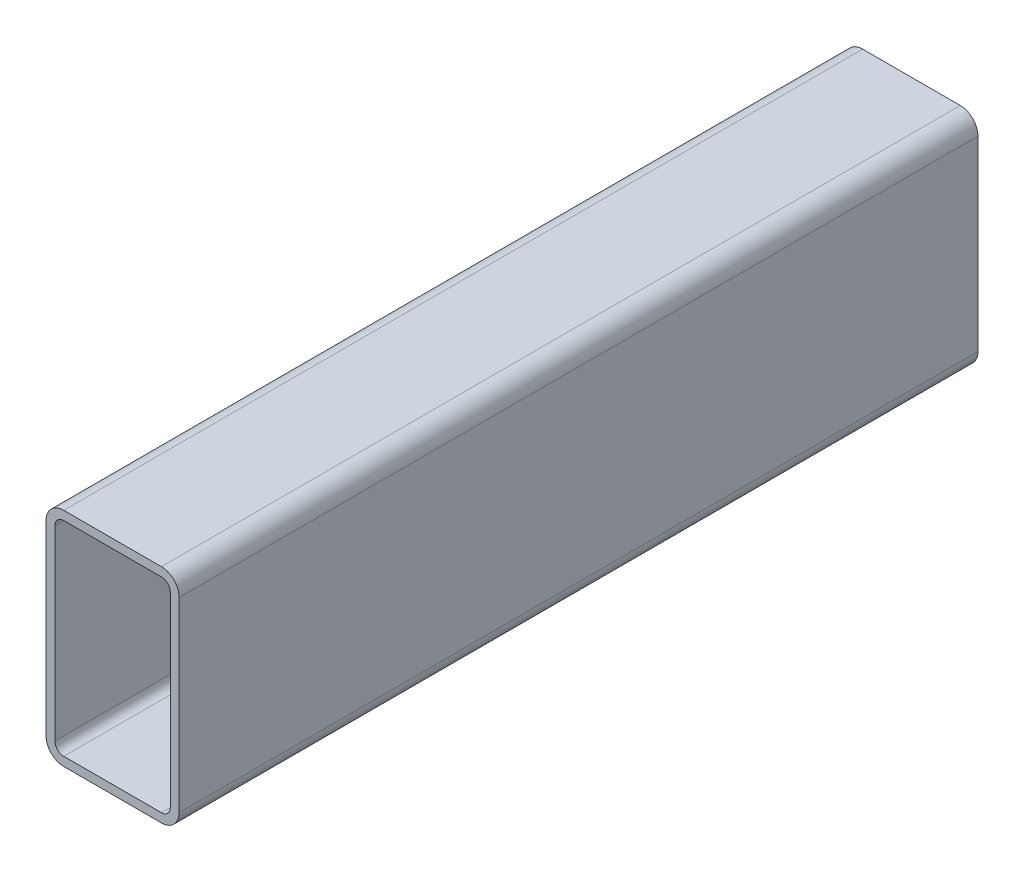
ISO-10303-21;
HEADER;
FILE_DESCRIPTION(('STEP AP214'),'2;1');
FILE_NAME('part.step','',(''),(''),'','','');
FILE_SCHEMA(('AUTOMOTIVE_DESIGN { 1 0 10303 214 1 1 1 1 }'));
ENDSEC;
DATA;
#1=APPLICATION_CONTEXT('core data for automotive mechanical design processes');
#2=APPLICATION_PROTOCOL_DEFINITION('international standard','automotive_design',2000,#1);
#3=PRODUCT_CONTEXT('',#1,'mechanical');
#4=PRODUCT('Part','Part','',(#3));
#5=PRODUCT_RELATED_PRODUCT_CATEGORY('part','',(#4));
#6=PRODUCT_DEFINITION_FORMATION('','',#4);
#7=PRODUCT_DEFINITION_CONTEXT('part definition',#1,'design');
#8=PRODUCT_DEFINITION('design','',#6,#7);
#9=PRODUCT_DEFINITION_SHAPE('','',#8);
#10=(LENGTH_UNIT() NAMED_UNIT(*) SI_UNIT(.MILLI.,.METRE.));
#11=(NAMED_UNIT(*) PLANE_ANGLE_UNIT() SI_UNIT($,.RADIAN.));
#12=(NAMED_UNIT(*) SI_UNIT($,.STERADIAN.) SOLID_ANGLE_UNIT());
#13=UNCERTAINTY_MEASURE_WITH_UNIT(LENGTH_MEASURE(1.E-05),#10,'distance_accuracy_value','');
#14=(GEOMETRIC_REPRESENTATION_CONTEXT(3) GLOBAL_UNCERTAINTY_ASSIGNED_CONTEXT((#13)) GLOBAL_UNIT_ASSIGNED_CONTEXT((#10,
#11,#12)) REPRESENTATION_CONTEXT('',''));
#15=CARTESIAN_POINT('',(0.,0.,0.));
#16=DIRECTION('',(0.,0.,1.));
#17=DIRECTION('',(1.,0.,0.));
#18=AXIS2_PLACEMENT_3D('',#15,#16,#17);
#19=CARTESIAN_POINT('',(19.9999999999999,20.,450.));
#20=DIRECTION('',(0.,0.,1.));
#21=DIRECTION('',(1.,0.,0.));
#22=AXIS2_PLACEMENT_3D('',#19,#20,#21);
#23=PLANE('',#22);
#24=CARTESIAN_POINT('',(19.9999999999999,20.,450.));
#25=DIRECTION('',(0.,0.,1.));
#26=DIRECTION('',(1.,0.,0.));
#27=AXIS2_PLACEMENT_3D('',#24,#25,#26);
#28=CIRCLE('',#27,20.);
#29=CARTESIAN_POINT('',(-1.11022302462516E-13,20.,450.));
#30=VERTEX_POINT('',#29);
#31=CARTESIAN_POINT('',(19.9999999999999,0.,450.));
#32=VERTEX_POINT('',#31);
#33=EDGE_CURVE('E225',#30,#32,#28,.T.);
#34=ORIENTED_EDGE('',*,*,#33,.T.);
#35=DIRECTION('',(1.,0.,0.));
#36=VECTOR('',#35,1.);
#37=CARTESIAN_POINT('',(19.9999999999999,0.,450.));
#38=LINE('',#37,#36);
#39=CARTESIAN_POINT('',(130.,0.,450.));
#40=VERTEX_POINT('',#39);
#41=EDGE_CURVE('E228',#32,#40,#38,.T.);
#42=ORIENTED_EDGE('',*,*,#41,.T.);
#43=CARTESIAN_POINT('',(130.,20.,450.));
#44=DIRECTION('',(0.,0.,1.));
#45=DIRECTION('',(1.,0.,0.));
#46=AXIS2_PLACEMENT_3D('',#43,#44,#45);
#47=CIRCLE('',#46,20.);
#48=CARTESIAN_POINT('',(150.,20.,450.));
#49=VERTEX_POINT('',#48);
#50=EDGE_CURVE('E230',#40,#49,#47,.T.);
#51=ORIENTED_EDGE('',*,*,#50,.T.);
#52=DIRECTION('',(0.,1.,0.));
#53=VECTOR('',#52,1.);
#54=CARTESIAN_POINT('',(150.,20.,450.));
#55=LINE('',#54,#53);
#56=CARTESIAN_POINT('',(150.,230.,450.));
#57=VERTEX_POINT('',#56);
#58=EDGE_CURVE('E232',#49,#57,#55,.T.);
#59=ORIENTED_EDGE('',*,*,#58,.T.);
#60=CARTESIAN_POINT('',(130.,230.,450.));
#61=DIRECTION('',(0.,0.,1.));
#62=DIRECTION('',(1.,0.,0.));
#63=AXIS2_PLACEMENT_3D('',#60,#61,#62);
#64=CIRCLE('',#63,20.);
#65=CARTESIAN_POINT('',(130.,250.,450.));
#66=VERTEX_POINT('',#65);
#67=EDGE_CURVE('E234',#57,#66,#64,.T.);
#68=ORIENTED_EDGE('',*,*,#67,.T.);
#69=DIRECTION('',(-1.,0.,0.));
#70=VECTOR('',#69,1.);
#71=CARTESIAN_POINT('',(130.,250.,450.));
#72=LINE('',#71,#70);
#73=CARTESIAN_POINT('',(20.,250.,450.));
#74=VERTEX_POINT('',#73);
#75=EDGE_CURVE('E236',#66,#74,#72,.T.);
#76=ORIENTED_EDGE('',*,*,#75,.T.);
#77=CARTESIAN_POINT('',(19.9999999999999,230.,450.));
#78=DIRECTION('',(0.,0.,1.));
#79=DIRECTION('',(1.,0.,0.));
#80=AXIS2_PLACEMENT_3D('',#77,#78,#79);
#81=CIRCLE('',#80,20.);
#82=CARTESIAN_POINT('',(-1.11022302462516E-13,230.,450.));
#83=VERTEX_POINT('',#82);
#84=EDGE_CURVE('E238',#74,#83,#81,.T.);
#85=ORIENTED_EDGE('',*,*,#84,.T.);
#86=DIRECTION('',(0.,-1.,0.));
#87=VECTOR('',#86,1.);
#88=CARTESIAN_POINT('',(-1.66533453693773E-13,230.,450.));
#89=LINE('',#88,#87);
#90=EDGE_CURVE('E240',#83,#30,#89,.T.);
#91=ORIENTED_EDGE('',*,*,#90,.T.);
#92=EDGE_LOOP('',(#34,#42,#51,#59,#68,#76,#85,#91));
#93=FACE_BOUND('',#92,.T.);
#94=DIRECTION('',(-1.,0.,0.));
#95=VECTOR('',#94,1.);
#96=CARTESIAN_POINT('',(130.,240.,450.));
#97=LINE('',#96,#95);
#98=CARTESIAN_POINT('',(130.,240.,450.));
#99=VERTEX_POINT('',#98);
#100=CARTESIAN_POINT('',(20.,240.,450.));
#101=VERTEX_POINT('',#100);
#102=EDGE_CURVE('E183',#99,#101,#97,.T.);
#103=ORIENTED_EDGE('',*,*,#102,.F.);
#104=CARTESIAN_POINT('',(130.,230.,450.));
#105=DIRECTION('',(0.,0.,1.));
#106=DIRECTION('',(1.,0.,0.));
#107=AXIS2_PLACEMENT_3D('',#104,#105,#106);
#108=CIRCLE('',#107,9.99999999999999);
#109=CARTESIAN_POINT('',(140.,230.,450.));
#110=VERTEX_POINT('',#109);
#111=EDGE_CURVE('E160',#110,#99,#108,.T.);
#112=ORIENTED_EDGE('',*,*,#111,.F.);
#113=DIRECTION('',(0.,1.,0.));
#114=VECTOR('',#113,1.);
#115=CARTESIAN_POINT('',(140.,20.,450.));
#116=LINE('',#115,#114);
#117=CARTESIAN_POINT('',(140.,20.,450.));
#118=VERTEX_POINT('',#117);
#119=EDGE_CURVE('E195',#118,#110,#116,.T.);
#120=ORIENTED_EDGE('',*,*,#119,.F.);
#121=CARTESIAN_POINT('',(130.,20.,450.));
#122=DIRECTION('',(0.,0.,1.));
#123=DIRECTION('',(1.,0.,0.));
#124=AXIS2_PLACEMENT_3D('',#121,#122,#123);
#125=CIRCLE('',#124,9.99999999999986);
#126=CARTESIAN_POINT('',(130.,10.,450.));
#127=VERTEX_POINT('',#126);
#128=EDGE_CURVE('E193',#127,#118,#125,.T.);
#129=ORIENTED_EDGE('',*,*,#128,.F.);
#130=DIRECTION('',(1.,0.,0.));
#131=VECTOR('',#130,1.);
#132=CARTESIAN_POINT('',(19.9999999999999,10.,450.));
#133=LINE('',#132,#131);
#134=CARTESIAN_POINT('',(19.9999999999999,10.,450.));
#135=VERTEX_POINT('',#134);
#136=EDGE_CURVE('E191',#135,#127,#133,.T.);
#137=ORIENTED_EDGE('',*,*,#136,.F.);
#138=CARTESIAN_POINT('',(19.9999999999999,20.,450.));
#139=DIRECTION('',(0.,0.,1.));
#140=DIRECTION('',(1.,0.,0.));
#141=AXIS2_PLACEMENT_3D('',#138,#139,#140);
#142=CIRCLE('',#141,10.);
#143=CARTESIAN_POINT('',(9.99999999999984,20.,450.));
#144=VERTEX_POINT('',#143);
#145=EDGE_CURVE('E189',#144,#135,#142,.T.);
#146=ORIENTED_EDGE('',*,*,#145,.F.);
#147=DIRECTION('',(0.,-1.,0.));
#148=VECTOR('',#147,1.);
#149=CARTESIAN_POINT('',(9.99999999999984,230.,450.));
#150=LINE('',#149,#148);
#151=CARTESIAN_POINT('',(9.99999999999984,230.,450.));
#152=VERTEX_POINT('',#151);
#153=EDGE_CURVE('E187',#152,#144,#150,.T.);
#154=ORIENTED_EDGE('',*,*,#153,.F.);
#155=CARTESIAN_POINT('',(19.9999999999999,230.,450.));
#156=DIRECTION('',(0.,0.,1.));
#157=DIRECTION('',(1.,0.,0.));
#158=AXIS2_PLACEMENT_3D('',#155,#156,#157);
#159=CIRCLE('',#158,9.99999999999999);
#160=EDGE_CURVE('E185',#101,#152,#159,.T.);
#161=ORIENTED_EDGE('',*,*,#160,.F.);
#162=EDGE_LOOP('',(#103,#112,#120,#129,#137,#146,#154,#161));
#163=FACE_BOUND('',#162,.T.);
#164=ADVANCED_FACE('F32',(#93,#163),#23,.T.);
#165=CARTESIAN_POINT('',(20.,20.,-450.));
#166=DIRECTION('',(0.,0.,1.));
#167=DIRECTION('',(1.,0.,0.));
#168=AXIS2_PLACEMENT_3D('',#165,#166,#167);
#169=PLANE('',#168);
#170=CARTESIAN_POINT('',(20.,20.,-450.));
#171=DIRECTION('',(0.,0.,1.));
#172=DIRECTION('',(1.,0.,0.));
#173=AXIS2_PLACEMENT_3D('',#170,#171,#172);
#174=CIRCLE('',#173,20.);
#175=CARTESIAN_POINT('',(0.,20.,-450.));
#176=VERTEX_POINT('',#175);
#177=CARTESIAN_POINT('',(20.,0.,-450.));
#178=VERTEX_POINT('',#177);
#179=EDGE_CURVE('E161',#176,#178,#174,.T.);
#180=ORIENTED_EDGE('',*,*,#179,.F.);
#181=DIRECTION('',(0.,-1.,0.));
#182=VECTOR('',#181,1.);
#183=CARTESIAN_POINT('',(0.,230.,-450.));
#184=LINE('',#183,#182);
#185=CARTESIAN_POINT('',(0.,230.,-450.));
#186=VERTEX_POINT('',#185);
#187=EDGE_CURVE('E223',#186,#176,#184,.T.);
#188=ORIENTED_EDGE('',*,*,#187,.F.);
#189=CARTESIAN_POINT('',(20.,230.,-450.));
#190=DIRECTION('',(0.,0.,1.));
#191=DIRECTION('',(1.,0.,0.));
#192=AXIS2_PLACEMENT_3D('',#189,#190,#191);
#193=CIRCLE('',#192,20.);
#194=CARTESIAN_POINT('',(20.,250.,-450.));
#195=VERTEX_POINT('',#194);
#196=EDGE_CURVE('E221',#195,#186,#193,.T.);
#197=ORIENTED_EDGE('',*,*,#196,.F.);
#198=DIRECTION('',(-1.,0.,0.));
#199=VECTOR('',#198,1.);
#200=CARTESIAN_POINT('',(130.,250.,-450.));
#201=LINE('',#200,#199);
#202=CARTESIAN_POINT('',(130.,250.,-450.));
#203=VERTEX_POINT('',#202);
#204=EDGE_CURVE('E219',#203,#195,#201,.T.);
#205=ORIENTED_EDGE('',*,*,#204,.F.);
#206=CARTESIAN_POINT('',(130.,230.,-450.));
#207=DIRECTION('',(0.,0.,1.));
#208=DIRECTION('',(1.,0.,0.));
#209=AXIS2_PLACEMENT_3D('',#206,#207,#208);
#210=CIRCLE('',#209,20.);
#211=CARTESIAN_POINT('',(150.,230.,-450.));
#212=VERTEX_POINT('',#211);
#213=EDGE_CURVE('E217',#212,#203,#210,.T.);
#214=ORIENTED_EDGE('',*,*,#213,.F.);
#215=DIRECTION('',(0.,1.,0.));
#216=VECTOR('',#215,1.);
#217=CARTESIAN_POINT('',(150.,20.,-450.));
#218=LINE('',#217,#216);
#219=CARTESIAN_POINT('',(150.,20.,-450.));
#220=VERTEX_POINT('',#219);
#221=EDGE_CURVE('E215',#220,#212,#218,.T.);
#222=ORIENTED_EDGE('',*,*,#221,.F.);
#223=CARTESIAN_POINT('',(130.,20.,-450.));
#224=DIRECTION('',(0.,0.,1.));
#225=DIRECTION('',(1.,0.,0.));
#226=AXIS2_PLACEMENT_3D('',#223,#224,#225);
#227=CIRCLE('',#226,20.);
#228=CARTESIAN_POINT('',(130.,0.,-450.));
#229=VERTEX_POINT('',#228);
#230=EDGE_CURVE('E213',#229,#220,#227,.T.);
#231=ORIENTED_EDGE('',*,*,#230,.F.);
#232=DIRECTION('',(1.,0.,0.));
#233=VECTOR('',#232,1.);
#234=CARTESIAN_POINT('',(20.,0.,-450.));
#235=LINE('',#234,#233);
#236=EDGE_CURVE('E211',#178,#229,#235,.T.);
#237=ORIENTED_EDGE('',*,*,#236,.F.);
#238=EDGE_LOOP('',(#180,#188,#197,#205,#214,#222,#231,#237));
#239=FACE_BOUND('',#238,.T.);
#240=CARTESIAN_POINT('',(130.,230.,-450.));
#241=DIRECTION('',(0.,0.,1.));
#242=DIRECTION('',(1.,0.,0.));
#243=AXIS2_PLACEMENT_3D('',#240,#241,#242);
#244=CIRCLE('',#243,9.99999999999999);
#245=CARTESIAN_POINT('',(140.,230.,-450.));
#246=VERTEX_POINT('',#245);
#247=CARTESIAN_POINT('',(130.,240.,-450.));
#248=VERTEX_POINT('',#247);
#249=EDGE_CURVE('E55',#246,#248,#244,.T.);
#250=ORIENTED_EDGE('',*,*,#249,.T.);
#251=DIRECTION('',(-1.,0.,0.));
#252=VECTOR('',#251,1.);
#253=CARTESIAN_POINT('',(130.,240.,-450.));
#254=LINE('',#253,#252);
#255=CARTESIAN_POINT('',(20.,240.,-450.));
#256=VERTEX_POINT('',#255);
#257=EDGE_CURVE('E147',#248,#256,#254,.T.);
#258=ORIENTED_EDGE('',*,*,#257,.T.);
#259=CARTESIAN_POINT('',(20.,230.,-450.));
#260=DIRECTION('',(0.,0.,1.));
#261=DIRECTION('',(1.,0.,0.));
#262=AXIS2_PLACEMENT_3D('',#259,#260,#261);
#263=CIRCLE('',#262,9.99999999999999);
#264=CARTESIAN_POINT('',(10.,230.,-450.));
#265=VERTEX_POINT('',#264);
#266=EDGE_CURVE('E156',#256,#265,#263,.T.);
#267=ORIENTED_EDGE('',*,*,#266,.T.);
#268=DIRECTION('',(0.,-1.,0.));
#269=VECTOR('',#268,1.);
#270=CARTESIAN_POINT('',(10.,230.,-450.));
#271=LINE('',#270,#269);
#272=CARTESIAN_POINT('',(10.,20.,-450.));
#273=VERTEX_POINT('',#272);
#274=EDGE_CURVE('E170',#265,#273,#271,.T.);
#275=ORIENTED_EDGE('',*,*,#274,.T.);
#276=CARTESIAN_POINT('',(20.,20.,-450.));
#277=DIRECTION('',(0.,0.,1.));
#278=DIRECTION('',(1.,0.,0.));
#279=AXIS2_PLACEMENT_3D('',#276,#277,#278);
#280=CIRCLE('',#279,10.);
#281=CARTESIAN_POINT('',(20.,10.,-450.));
#282=VERTEX_POINT('',#281);
#283=EDGE_CURVE('E173',#273,#282,#280,.T.);
#284=ORIENTED_EDGE('',*,*,#283,.T.);
#285=DIRECTION('',(1.,0.,0.));
#286=VECTOR('',#285,1.);
#287=CARTESIAN_POINT('',(20.,10.,-450.));
#288=LINE('',#287,#286);
#289=CARTESIAN_POINT('',(130.,10.,-450.));
#290=VERTEX_POINT('',#289);
#291=EDGE_CURVE('E176',#282,#290,#288,.T.);
#292=ORIENTED_EDGE('',*,*,#291,.T.);
#293=CARTESIAN_POINT('',(130.,20.,-450.));
#294=DIRECTION('',(0.,0.,1.));
#295=DIRECTION('',(1.,0.,0.));
#296=AXIS2_PLACEMENT_3D('',#293,#294,#295);
#297=CIRCLE('',#296,9.99999999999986);
#298=CARTESIAN_POINT('',(140.,20.,-450.));
#299=VERTEX_POINT('',#298);
#300=EDGE_CURVE('E179',#290,#299,#297,.T.);
#301=ORIENTED_EDGE('',*,*,#300,.T.);
#302=DIRECTION('',(0.,1.,0.));
#303=VECTOR('',#302,1.);
#304=CARTESIAN_POINT('',(140.,20.,-450.));
#305=LINE('',#304,#303);
#306=EDGE_CURVE('E166',#299,#246,#305,.T.);
#307=ORIENTED_EDGE('',*,*,#306,.T.);
#308=EDGE_LOOP('',(#250,#258,#267,#275,#284,#292,#301,#307));
#309=FACE_BOUND('',#308,.T.);
#310=ADVANCED_FACE('F164',(#239,#309),#169,.F.);
#311=CARTESIAN_POINT('',(19.9999999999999,20.,450.));
#312=DIRECTION('',(0.,0.,-1.));
#313=DIRECTION('',(-1.,0.,0.));
#314=AXIS2_PLACEMENT_3D('',#311,#312,#313);
#315=CYLINDRICAL_SURFACE('',#314,20.);
#316=ORIENTED_EDGE('',*,*,#179,.T.);
#317=DIRECTION('',(0.,0.,-1.));
#318=VECTOR('',#317,1.);
#319=CARTESIAN_POINT('',(19.9999999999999,0.,450.));
#320=LINE('',#319,#318);
#321=EDGE_CURVE('E11',#32,#178,#320,.T.);
#322=ORIENTED_EDGE('',*,*,#321,.F.);
#323=ORIENTED_EDGE('',*,*,#33,.F.);
#324=DIRECTION('',(0.,0.,-1.));
#325=VECTOR('',#324,1.);
#326=CARTESIAN_POINT('',(-1.11022302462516E-13,20.,450.));
#327=LINE('',#326,#325);
#328=EDGE_CURVE('E242',#30,#176,#327,.T.);
#329=ORIENTED_EDGE('',*,*,#328,.T.);
#330=EDGE_LOOP('',(#316,#322,#323,#329));
#331=FACE_BOUND('',#330,.T.);
#332=ADVANCED_FACE('F34',(#331),#315,.T.);
#333=CARTESIAN_POINT('',(19.9999999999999,0.,450.));
#334=DIRECTION('',(0.,1.,0.));
#335=DIRECTION('',(0.,0.,1.));
#336=AXIS2_PLACEMENT_3D('',#333,#334,#335);
#337=PLANE('',#336);
#338=ORIENTED_EDGE('',*,*,#236,.T.);
#339=DIRECTION('',(0.,0.,-1.));
#340=VECTOR('',#339,1.);
#341=CARTESIAN_POINT('',(130.,0.,450.));
#342=LINE('',#341,#340);
#343=EDGE_CURVE('E40',#40,#229,#342,.T.);
#344=ORIENTED_EDGE('',*,*,#343,.F.);
#345=ORIENTED_EDGE('',*,*,#41,.F.);
#346=ORIENTED_EDGE('',*,*,#321,.T.);
#347=EDGE_LOOP('',(#338,#344,#345,#346));
#348=FACE_BOUND('',#347,.T.);
#349=ADVANCED_FACE('F286',(#348),#337,.F.);
#350=CARTESIAN_POINT('',(130.,20.,450.));
#351=DIRECTION('',(0.,0.,-1.));
#352=DIRECTION('',(-1.,0.,0.));
#353=AXIS2_PLACEMENT_3D('',#350,#351,#352);
#354=CYLINDRICAL_SURFACE('',#353,20.);
#355=ORIENTED_EDGE('',*,*,#230,.T.);
#356=DIRECTION('',(0.,0.,-1.));
#357=VECTOR('',#356,1.);
#358=CARTESIAN_POINT('',(150.,20.,450.));
#359=LINE('',#358,#357);
#360=EDGE_CURVE('E257',#49,#220,#359,.T.);
#361=ORIENTED_EDGE('',*,*,#360,.F.);
#362=ORIENTED_EDGE('',*,*,#50,.F.);
#363=ORIENTED_EDGE('',*,*,#343,.T.);
#364=EDGE_LOOP('',(#355,#361,#362,#363));
#365=FACE_BOUND('',#364,.T.);
#366=ADVANCED_FACE('F264',(#365),#354,.T.);
#367=CARTESIAN_POINT('',(150.,20.,450.));
#368=DIRECTION('',(-1.,0.,0.));
#369=DIRECTION('',(0.,-1.,0.));
#370=AXIS2_PLACEMENT_3D('',#367,#368,#369);
#371=PLANE('',#370);
#372=ORIENTED_EDGE('',*,*,#221,.T.);
#373=DIRECTION('',(0.,0.,-1.));
#374=VECTOR('',#373,1.);
#375=CARTESIAN_POINT('',(150.,230.,450.));
#376=LINE('',#375,#374);
#377=EDGE_CURVE('E254',#57,#212,#376,.T.);
#378=ORIENTED_EDGE('',*,*,#377,.F.);
#379=ORIENTED_EDGE('',*,*,#58,.F.);
#380=ORIENTED_EDGE('',*,*,#360,.T.);
#381=EDGE_LOOP('',(#372,#378,#379,#380));
#382=FACE_BOUND('',#381,.T.);
#383=ADVANCED_FACE('F274',(#382),#371,.F.);
#384=CARTESIAN_POINT('',(130.,230.,450.));
#385=DIRECTION('',(0.,0.,-1.));
#386=DIRECTION('',(-1.,0.,0.));
#387=AXIS2_PLACEMENT_3D('',#384,#385,#386);
#388=CYLINDRICAL_SURFACE('',#387,20.);
#389=ORIENTED_EDGE('',*,*,#213,.T.);
#390=DIRECTION('',(0.,0.,-1.));
#391=VECTOR('',#390,1.);
#392=CARTESIAN_POINT('',(130.,250.,450.));
#393=LINE('',#392,#391);
#394=EDGE_CURVE('E251',#66,#203,#393,.T.);
#395=ORIENTED_EDGE('',*,*,#394,.F.);
#396=ORIENTED_EDGE('',*,*,#67,.F.);
#397=ORIENTED_EDGE('',*,*,#377,.T.);
#398=EDGE_LOOP('',(#389,#395,#396,#397));
#399=FACE_BOUND('',#398,.T.);
#400=ADVANCED_FACE('F278',(#399),#388,.T.);
#401=CARTESIAN_POINT('',(130.,250.,450.));
#402=DIRECTION('',(0.,-1.,0.));
#403=DIRECTION('',(1.,0.,0.));
#404=AXIS2_PLACEMENT_3D('',#401,#402,#403);
#405=PLANE('',#404);
#406=ORIENTED_EDGE('',*,*,#204,.T.);
#407=DIRECTION('',(0.,0.,-1.));
#408=VECTOR('',#407,1.);
#409=CARTESIAN_POINT('',(20.,250.,450.));
#410=LINE('',#409,#408);
#411=EDGE_CURVE('E248',#74,#195,#410,.T.);
#412=ORIENTED_EDGE('',*,*,#411,.F.);
#413=ORIENTED_EDGE('',*,*,#75,.F.);
#414=ORIENTED_EDGE('',*,*,#394,.T.);
#415=EDGE_LOOP('',(#406,#412,#413,#414));
#416=FACE_BOUND('',#415,.T.);
#417=ADVANCED_FACE('F299',(#416),#405,.F.);
#418=CARTESIAN_POINT('',(19.9999999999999,230.,450.));
#419=DIRECTION('',(0.,0.,-1.));
#420=DIRECTION('',(-1.,0.,0.));
#421=AXIS2_PLACEMENT_3D('',#418,#419,#420);
#422=CYLINDRICAL_SURFACE('',#421,20.);
#423=ORIENTED_EDGE('',*,*,#196,.T.);
#424=DIRECTION('',(0.,0.,-1.));
#425=VECTOR('',#424,1.);
#426=CARTESIAN_POINT('',(-1.11022302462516E-13,230.,450.));
#427=LINE('',#426,#425);
#428=EDGE_CURVE('E245',#83,#186,#427,.T.);
#429=ORIENTED_EDGE('',*,*,#428,.F.);
#430=ORIENTED_EDGE('',*,*,#84,.F.);
#431=ORIENTED_EDGE('',*,*,#411,.T.);
#432=EDGE_LOOP('',(#423,#429,#430,#431));
#433=FACE_BOUND('',#432,.T.);
#434=ADVANCED_FACE('F297',(#433),#422,.T.);
#435=CARTESIAN_POINT('',(-1.66533453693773E-13,230.,450.));
#436=DIRECTION('',(1.,0.,0.));
#437=DIRECTION('',(0.,1.,0.));
#438=AXIS2_PLACEMENT_3D('',#435,#436,#437);
#439=PLANE('',#438);
#440=ORIENTED_EDGE('',*,*,#187,.T.);
#441=ORIENTED_EDGE('',*,*,#328,.F.);
#442=ORIENTED_EDGE('',*,*,#90,.F.);
#443=ORIENTED_EDGE('',*,*,#428,.T.);
#444=EDGE_LOOP('',(#440,#441,#442,#443));
#445=FACE_BOUND('',#444,.T.);
#446=ADVANCED_FACE('F292',(#445),#439,.F.);
#447=CARTESIAN_POINT('',(130.,230.,450.));
#448=DIRECTION('',(0.,0.,-1.));
#449=DIRECTION('',(-1.,0.,0.));
#450=AXIS2_PLACEMENT_3D('',#447,#448,#449);
#451=CYLINDRICAL_SURFACE('',#450,9.99999999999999);
#452=ORIENTED_EDGE('',*,*,#249,.F.);
#453=DIRECTION('',(0.,0.,-1.));
#454=VECTOR('',#453,1.);
#455=CARTESIAN_POINT('',(140.,230.,450.));
#456=LINE('',#455,#454);
#457=EDGE_CURVE('E197',#110,#246,#456,.T.);
#458=ORIENTED_EDGE('',*,*,#457,.F.);
#459=ORIENTED_EDGE('',*,*,#111,.T.);
#460=DIRECTION('',(0.,0.,-1.));
#461=VECTOR('',#460,1.);
#462=CARTESIAN_POINT('',(130.,240.,450.));
#463=LINE('',#462,#461);
#464=EDGE_CURVE('E149',#99,#248,#463,.T.);
#465=ORIENTED_EDGE('',*,*,#464,.T.);
#466=EDGE_LOOP('',(#452,#458,#459,#465));
#467=FACE_BOUND('',#466,.T.);
#468=ADVANCED_FACE('F158',(#467),#451,.F.);
#469=CARTESIAN_POINT('',(130.,240.,450.));
#470=DIRECTION('',(0.,-1.,0.));
#471=DIRECTION('',(0.,0.,-1.));
#472=AXIS2_PLACEMENT_3D('',#469,#470,#471);
#473=PLANE('',#472);
#474=ORIENTED_EDGE('',*,*,#257,.F.);
#475=ORIENTED_EDGE('',*,*,#464,.F.);
#476=ORIENTED_EDGE('',*,*,#102,.T.);
#477=DIRECTION('',(0.,0.,-1.));
#478=VECTOR('',#477,1.);
#479=CARTESIAN_POINT('',(20.,240.,450.));
#480=LINE('',#479,#478);
#481=EDGE_CURVE('E152',#101,#256,#480,.T.);
#482=ORIENTED_EDGE('',*,*,#481,.T.);
#483=EDGE_LOOP('',(#474,#475,#476,#482));
#484=FACE_BOUND('',#483,.T.);
#485=ADVANCED_FACE('F148',(#484),#473,.T.);
#486=CARTESIAN_POINT('',(19.9999999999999,230.,450.));
#487=DIRECTION('',(0.,0.,-1.));
#488=DIRECTION('',(-1.,0.,0.));
#489=AXIS2_PLACEMENT_3D('',#486,#487,#488);
#490=CYLINDRICAL_SURFACE('',#489,9.99999999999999);
#491=ORIENTED_EDGE('',*,*,#266,.F.);
#492=ORIENTED_EDGE('',*,*,#481,.F.);
#493=ORIENTED_EDGE('',*,*,#160,.T.);
#494=DIRECTION('',(0.,0.,-1.));
#495=VECTOR('',#494,1.);
#496=CARTESIAN_POINT('',(9.99999999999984,230.,450.));
#497=LINE('',#496,#495);
#498=EDGE_CURVE('E206',#152,#265,#497,.T.);
#499=ORIENTED_EDGE('',*,*,#498,.T.);
#500=EDGE_LOOP('',(#491,#492,#493,#499));
#501=FACE_BOUND('',#500,.T.);
#502=ADVANCED_FACE('F323',(#501),#490,.F.);
#503=CARTESIAN_POINT('',(9.99999999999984,230.,450.));
#504=DIRECTION('',(1.,0.,0.));
#505=DIRECTION('',(0.,1.,0.));
#506=AXIS2_PLACEMENT_3D('',#503,#504,#505);
#507=PLANE('',#506);
#508=ORIENTED_EDGE('',*,*,#274,.F.);
#509=ORIENTED_EDGE('',*,*,#498,.F.);
#510=ORIENTED_EDGE('',*,*,#153,.T.);
#511=DIRECTION('',(0.,0.,-1.));
#512=VECTOR('',#511,1.);
#513=CARTESIAN_POINT('',(9.99999999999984,20.,450.));
#514=LINE('',#513,#512);
#515=EDGE_CURVE('E204',#144,#273,#514,.T.);
#516=ORIENTED_EDGE('',*,*,#515,.T.);
#517=EDGE_LOOP('',(#508,#509,#510,#516));
#518=FACE_BOUND('',#517,.T.);
#519=ADVANCED_FACE('F328',(#518),#507,.T.);
#520=CARTESIAN_POINT('',(19.9999999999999,20.,450.));
#521=DIRECTION('',(0.,0.,-1.));
#522=DIRECTION('',(-1.,0.,0.));
#523=AXIS2_PLACEMENT_3D('',#520,#521,#522);
#524=CYLINDRICAL_SURFACE('',#523,10.);
#525=ORIENTED_EDGE('',*,*,#283,.F.);
#526=ORIENTED_EDGE('',*,*,#515,.F.);
#527=ORIENTED_EDGE('',*,*,#145,.T.);
#528=DIRECTION('',(0.,0.,-1.));
#529=VECTOR('',#528,1.);
#530=CARTESIAN_POINT('',(19.9999999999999,10.,450.));
#531=LINE('',#530,#529);
#532=EDGE_CURVE('E202',#135,#282,#531,.T.);
#533=ORIENTED_EDGE('',*,*,#532,.T.);
#534=EDGE_LOOP('',(#525,#526,#527,#533));
#535=FACE_BOUND('',#534,.T.);
#536=ADVANCED_FACE('F332',(#535),#524,.F.);
#537=CARTESIAN_POINT('',(19.9999999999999,10.,450.));
#538=DIRECTION('',(0.,1.,0.));
#539=DIRECTION('',(-1.,0.,0.));
#540=AXIS2_PLACEMENT_3D('',#537,#538,#539);
#541=PLANE('',#540);
#542=ORIENTED_EDGE('',*,*,#291,.F.);
#543=ORIENTED_EDGE('',*,*,#532,.F.);
#544=ORIENTED_EDGE('',*,*,#136,.T.);
#545=DIRECTION('',(0.,0.,-1.));
#546=VECTOR('',#545,1.);
#547=CARTESIAN_POINT('',(130.,10.,450.));
#548=LINE('',#547,#546);
#549=EDGE_CURVE('E200',#127,#290,#548,.T.);
#550=ORIENTED_EDGE('',*,*,#549,.T.);
#551=EDGE_LOOP('',(#542,#543,#544,#550));
#552=FACE_BOUND('',#551,.T.);
#553=ADVANCED_FACE('F336',(#552),#541,.T.);
#554=CARTESIAN_POINT('',(130.,20.,450.));
#555=DIRECTION('',(0.,0.,-1.));
#556=DIRECTION('',(-1.,0.,0.));
#557=AXIS2_PLACEMENT_3D('',#554,#555,#556);
#558=CYLINDRICAL_SURFACE('',#557,9.99999999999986);
#559=ORIENTED_EDGE('',*,*,#300,.F.);
#560=ORIENTED_EDGE('',*,*,#549,.F.);
#561=ORIENTED_EDGE('',*,*,#128,.T.);
#562=DIRECTION('',(0.,0.,-1.));
#563=VECTOR('',#562,1.);
#564=CARTESIAN_POINT('',(140.,20.,450.));
#565=LINE('',#564,#563);
#566=EDGE_CURVE('E47',#118,#299,#565,.T.);
#567=ORIENTED_EDGE('',*,*,#566,.T.);
#568=EDGE_LOOP('',(#559,#560,#561,#567));
#569=FACE_BOUND('',#568,.T.);
#570=ADVANCED_FACE('F340',(#569),#558,.F.);
#571=CARTESIAN_POINT('',(140.,20.,450.));
#572=DIRECTION('',(-1.,0.,0.));
#573=DIRECTION('',(0.,-1.,0.));
#574=AXIS2_PLACEMENT_3D('',#571,#572,#573);
#575=PLANE('',#574);
#576=ORIENTED_EDGE('',*,*,#306,.F.);
#577=ORIENTED_EDGE('',*,*,#566,.F.);
#578=ORIENTED_EDGE('',*,*,#119,.T.);
#579=ORIENTED_EDGE('',*,*,#457,.T.);
#580=EDGE_LOOP('',(#576,#577,#578,#579));
#581=FACE_BOUND('',#580,.T.);
#582=ADVANCED_FACE('F344',(#581),#575,.T.);
#583=CLOSED_SHELL('',(#164,#310,#332,#349,#366,#383,#400,#417,#434,#446,#468,#485,#502,#519,
#536,#553,#570,#582));
#584=MANIFOLD_SOLID_BREP('B2',#583);
#585=ADVANCED_BREP_SHAPE_REPRESENTATION('',(#18,#584),#14);
#586=SHAPE_DEFINITION_REPRESENTATION(#9,#585);
ENDSEC;
END-ISO-10303-21;
